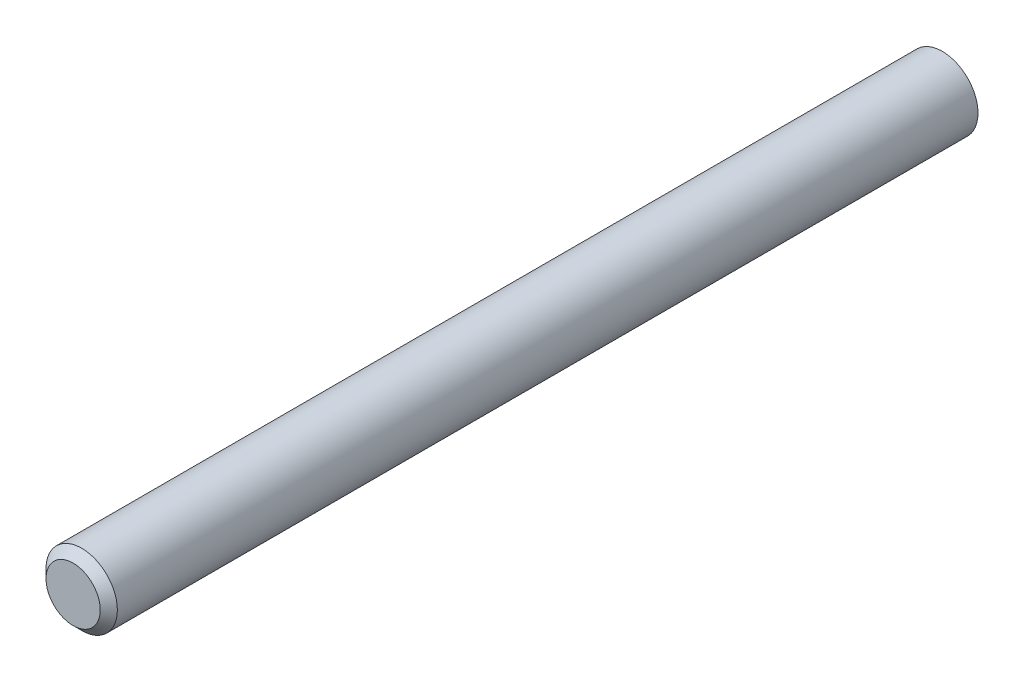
from build123d import *

# Parameters (mm, degrees)
SKETCH1_R           = 3.175
BOSS_EXTRUDE3_DEPTH = 77.343
CHAMFER1_SIZE       = 0.762


with BuildPart() as part:
    # Sketch1 → Boss-Extrude3 (new body)
    with BuildSketch(Plane.XY):
        Circle(SKETCH1_R)
    extrude(amount=BOSS_EXTRUDE3_DEPTH)

    # Chamfer1
    chamfer1_edges = [part.edges().sort_by_distance(p)[0] for p in [
        (-3.175, 0, 77.343),
    ]]
    chamfer(chamfer1_edges, length=CHAMFER1_SIZE)


solid = part.part
